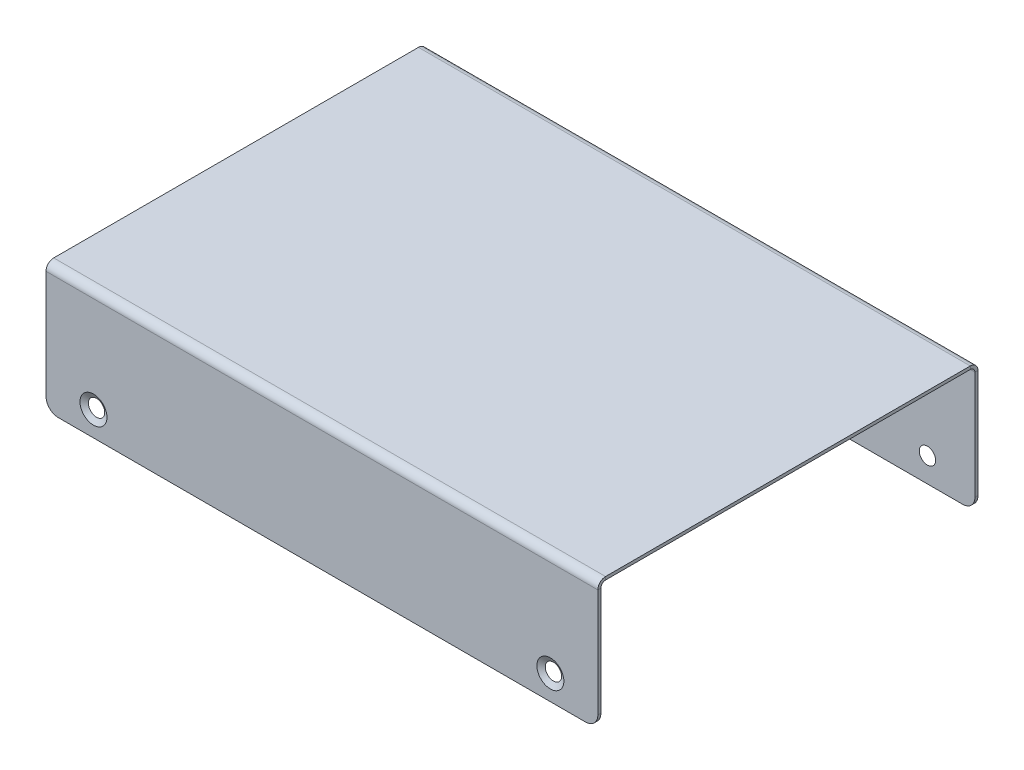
ISO-10303-21;
HEADER;
FILE_DESCRIPTION(('STEP AP214'),'2;1');
FILE_NAME('part.step','',(''),(''),'','','');
FILE_SCHEMA(('AUTOMOTIVE_DESIGN { 1 0 10303 214 1 1 1 1 }'));
ENDSEC;
DATA;
#1=APPLICATION_CONTEXT('core data for automotive mechanical design processes');
#2=APPLICATION_PROTOCOL_DEFINITION('international standard','automotive_design',2000,#1);
#3=PRODUCT_CONTEXT('',#1,'mechanical');
#4=PRODUCT('Part','Part','',(#3));
#5=PRODUCT_RELATED_PRODUCT_CATEGORY('part','',(#4));
#6=PRODUCT_DEFINITION_FORMATION('','',#4);
#7=PRODUCT_DEFINITION_CONTEXT('part definition',#1,'design');
#8=PRODUCT_DEFINITION('design','',#6,#7);
#9=PRODUCT_DEFINITION_SHAPE('','',#8);
#10=(LENGTH_UNIT() NAMED_UNIT(*) SI_UNIT(.MILLI.,.METRE.));
#11=(NAMED_UNIT(*) PLANE_ANGLE_UNIT() SI_UNIT($,.RADIAN.));
#12=(NAMED_UNIT(*) SI_UNIT($,.STERADIAN.) SOLID_ANGLE_UNIT());
#13=UNCERTAINTY_MEASURE_WITH_UNIT(LENGTH_MEASURE(1.E-05),#10,'distance_accuracy_value','');
#14=(GEOMETRIC_REPRESENTATION_CONTEXT(3) GLOBAL_UNCERTAINTY_ASSIGNED_CONTEXT((#13)) GLOBAL_UNIT_ASSIGNED_CONTEXT((#10,
#11,#12)) REPRESENTATION_CONTEXT('',''));
#15=CARTESIAN_POINT('',(0.,0.,0.));
#16=DIRECTION('',(0.,0.,1.));
#17=DIRECTION('',(1.,0.,0.));
#18=AXIS2_PLACEMENT_3D('',#15,#16,#17);
#19=CARTESIAN_POINT('',(0.,-0.5,0.));
#20=DIRECTION('',(0.,1.,0.));
#21=DIRECTION('',(0.,0.,1.));
#22=AXIS2_PLACEMENT_3D('',#19,#20,#21);
#23=PLANE('',#22);
#24=DIRECTION('',(1.,0.,0.));
#25=VECTOR('',#24,1.);
#26=CARTESIAN_POINT('',(44.99,-0.500000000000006,-29.73554));
#27=LINE('',#26,#25);
#28=CARTESIAN_POINT('',(44.99,-0.500000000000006,-29.73554));
#29=VERTEX_POINT('',#28);
#30=CARTESIAN_POINT('',(-44.99,-0.500000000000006,-29.73554));
#31=VERTEX_POINT('',#30);
#32=EDGE_CURVE('E206',#29,#31,#27,.F.);
#33=ORIENTED_EDGE('',*,*,#32,.F.);
#34=DIRECTION('',(0.,0.,-1.));
#35=VECTOR('',#34,1.);
#36=CARTESIAN_POINT('',(44.99,-0.5,-30.495));
#37=LINE('',#36,#35);
#38=CARTESIAN_POINT('',(44.99,-0.5,29.73554));
#39=VERTEX_POINT('',#38);
#40=EDGE_CURVE('E263',#39,#29,#37,.T.);
#41=ORIENTED_EDGE('',*,*,#40,.F.);
#42=DIRECTION('',(-1.,0.,0.));
#43=VECTOR('',#42,1.);
#44=CARTESIAN_POINT('',(-44.99,-0.5,29.73554));
#45=LINE('',#44,#43);
#46=CARTESIAN_POINT('',(-44.99,-0.5,29.73554));
#47=VERTEX_POINT('',#46);
#48=EDGE_CURVE('E250',#47,#39,#45,.F.);
#49=ORIENTED_EDGE('',*,*,#48,.F.);
#50=DIRECTION('',(0.,0.,1.));
#51=VECTOR('',#50,1.);
#52=CARTESIAN_POINT('',(-44.99,-0.5,-30.495));
#53=LINE('',#52,#51);
#54=EDGE_CURVE('E260',#31,#47,#53,.T.);
#55=ORIENTED_EDGE('',*,*,#54,.F.);
#56=EDGE_LOOP('',(#33,#41,#49,#55));
#57=FACE_BOUND('',#56,.T.);
#58=ADVANCED_FACE('F36',(#57),#23,.F.);
#59=CARTESIAN_POINT('',(0.,0.,0.));
#60=DIRECTION('',(0.,1.,0.));
#61=DIRECTION('',(0.,0.,1.));
#62=AXIS2_PLACEMENT_3D('',#59,#60,#61);
#63=PLANE('',#62);
#64=DIRECTION('',(0.,0.,-1.));
#65=VECTOR('',#64,1.);
#66=CARTESIAN_POINT('',(44.99,0.,-30.495));
#67=LINE('',#66,#65);
#68=CARTESIAN_POINT('',(44.99,0.,29.73554));
#69=VERTEX_POINT('',#68);
#70=CARTESIAN_POINT('',(44.99,0.,-29.73554));
#71=VERTEX_POINT('',#70);
#72=EDGE_CURVE('E264',#69,#71,#67,.T.);
#73=ORIENTED_EDGE('',*,*,#72,.T.);
#74=DIRECTION('',(1.,0.,0.));
#75=VECTOR('',#74,1.);
#76=CARTESIAN_POINT('',(44.99,0.,-29.73554));
#77=LINE('',#76,#75);
#78=CARTESIAN_POINT('',(-44.99,0.,-29.73554));
#79=VERTEX_POINT('',#78);
#80=EDGE_CURVE('E158',#71,#79,#77,.F.);
#81=ORIENTED_EDGE('',*,*,#80,.T.);
#82=DIRECTION('',(0.,0.,1.));
#83=VECTOR('',#82,1.);
#84=CARTESIAN_POINT('',(-44.99,0.,-30.495));
#85=LINE('',#84,#83);
#86=CARTESIAN_POINT('',(-44.99,0.,29.73554));
#87=VERTEX_POINT('',#86);
#88=EDGE_CURVE('E257',#79,#87,#85,.T.);
#89=ORIENTED_EDGE('',*,*,#88,.T.);
#90=DIRECTION('',(-1.,0.,0.));
#91=VECTOR('',#90,1.);
#92=CARTESIAN_POINT('',(-44.99,0.,29.73554));
#93=LINE('',#92,#91);
#94=EDGE_CURVE('E237',#87,#69,#93,.F.);
#95=ORIENTED_EDGE('',*,*,#94,.T.);
#96=EDGE_LOOP('',(#73,#81,#89,#95));
#97=FACE_BOUND('',#96,.T.);
#98=ADVANCED_FACE('F369',(#97),#63,.T.);
#99=CARTESIAN_POINT('',(44.99,-0.5,-30.495));
#100=DIRECTION('',(1.,0.,0.));
#101=DIRECTION('',(0.,0.,-1.));
#102=AXIS2_PLACEMENT_3D('',#99,#100,#101);
#103=PLANE('',#102);
#104=ORIENTED_EDGE('',*,*,#40,.T.);
#105=DIRECTION('',(0.,1.,0.));
#106=VECTOR('',#105,1.);
#107=CARTESIAN_POINT('',(44.99,-0.500000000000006,-29.73554));
#108=LINE('',#107,#106);
#109=EDGE_CURVE('E202',#29,#71,#108,.T.);
#110=ORIENTED_EDGE('',*,*,#109,.T.);
#111=ORIENTED_EDGE('',*,*,#72,.F.);
#112=DIRECTION('',(0.,1.,0.));
#113=VECTOR('',#112,1.);
#114=CARTESIAN_POINT('',(44.99,-0.5,29.73554));
#115=LINE('',#114,#113);
#116=EDGE_CURVE('E254',#39,#69,#115,.T.);
#117=ORIENTED_EDGE('',*,*,#116,.F.);
#118=EDGE_LOOP('',(#104,#110,#111,#117));
#119=FACE_BOUND('',#118,.T.);
#120=ADVANCED_FACE('F375',(#119),#103,.T.);
#121=CARTESIAN_POINT('',(-44.99,-0.5,-30.495));
#122=DIRECTION('',(-1.,0.,0.));
#123=DIRECTION('',(0.,0.,1.));
#124=AXIS2_PLACEMENT_3D('',#121,#122,#123);
#125=PLANE('',#124);
#126=DIRECTION('',(0.,1.,0.));
#127=VECTOR('',#126,1.);
#128=CARTESIAN_POINT('',(-44.99,-0.500000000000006,-29.73554));
#129=LINE('',#128,#127);
#130=EDGE_CURVE('E209',#31,#79,#129,.T.);
#131=ORIENTED_EDGE('',*,*,#130,.F.);
#132=ORIENTED_EDGE('',*,*,#54,.T.);
#133=DIRECTION('',(0.,1.,0.));
#134=VECTOR('',#133,1.);
#135=CARTESIAN_POINT('',(-44.99,-0.5,29.73554));
#136=LINE('',#135,#134);
#137=EDGE_CURVE('E244',#47,#87,#136,.T.);
#138=ORIENTED_EDGE('',*,*,#137,.T.);
#139=ORIENTED_EDGE('',*,*,#88,.F.);
#140=EDGE_LOOP('',(#131,#132,#138,#139));
#141=FACE_BOUND('',#140,.T.);
#142=ADVANCED_FACE('F385',(#141),#125,.T.);
#143=CARTESIAN_POINT('',(44.99,-1.25946,29.73554));
#144=DIRECTION('',(1.,0.,0.));
#145=DIRECTION('',(0.,0.,-1.));
#146=AXIS2_PLACEMENT_3D('',#143,#144,#145);
#147=PLANE('',#146);
#148=DIRECTION('',(0.,0.,1.));
#149=VECTOR('',#148,1.);
#150=CARTESIAN_POINT('',(44.99,-1.25946,30.495));
#151=LINE('',#150,#149);
#152=CARTESIAN_POINT('',(44.99,-1.25945999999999,30.495));
#153=VERTEX_POINT('',#152);
#154=CARTESIAN_POINT('',(44.99,-1.25945999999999,30.995));
#155=VERTEX_POINT('',#154);
#156=EDGE_CURVE('E212',#153,#155,#151,.T.);
#157=ORIENTED_EDGE('',*,*,#156,.F.);
#158=CARTESIAN_POINT('',(44.99,-1.25946,29.73554));
#159=DIRECTION('',(-1.,0.,0.));
#160=DIRECTION('',(0.,0.,1.));
#161=AXIS2_PLACEMENT_3D('',#158,#159,#160);
#162=CIRCLE('',#161,0.759459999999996);
#163=EDGE_CURVE('E247',#39,#153,#162,.F.);
#164=ORIENTED_EDGE('',*,*,#163,.F.);
#165=ORIENTED_EDGE('',*,*,#116,.T.);
#166=CARTESIAN_POINT('',(44.99,-1.25946,29.73554));
#167=DIRECTION('',(-1.,0.,0.));
#168=DIRECTION('',(0.,0.,1.));
#169=AXIS2_PLACEMENT_3D('',#166,#167,#168);
#170=CIRCLE('',#169,1.25946);
#171=EDGE_CURVE('E240',#69,#155,#170,.F.);
#172=ORIENTED_EDGE('',*,*,#171,.T.);
#173=EDGE_LOOP('',(#157,#164,#165,#172));
#174=FACE_BOUND('',#173,.T.);
#175=ADVANCED_FACE('F389',(#174),#147,.T.);
#176=CARTESIAN_POINT('',(-44.99,-1.25946,29.73554));
#177=DIRECTION('',(1.,0.,0.));
#178=DIRECTION('',(0.,0.,-1.));
#179=AXIS2_PLACEMENT_3D('',#176,#177,#178);
#180=PLANE('',#179);
#181=CARTESIAN_POINT('',(-44.99,-1.25946,29.73554));
#182=DIRECTION('',(-1.,0.,0.));
#183=DIRECTION('',(0.,0.,1.));
#184=AXIS2_PLACEMENT_3D('',#181,#182,#183);
#185=CIRCLE('',#184,0.759459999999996);
#186=CARTESIAN_POINT('',(-44.99,-1.25945999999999,30.495));
#187=VERTEX_POINT('',#186);
#188=EDGE_CURVE('E232',#187,#47,#185,.T.);
#189=ORIENTED_EDGE('',*,*,#188,.F.);
#190=DIRECTION('',(0.,0.,1.));
#191=VECTOR('',#190,1.);
#192=CARTESIAN_POINT('',(-44.99,-1.25946,30.495));
#193=LINE('',#192,#191);
#194=CARTESIAN_POINT('',(-44.99,-1.25946,30.995));
#195=VERTEX_POINT('',#194);
#196=EDGE_CURVE('E216',#187,#195,#193,.T.);
#197=ORIENTED_EDGE('',*,*,#196,.T.);
#198=CARTESIAN_POINT('',(-44.99,-1.25946,29.73554));
#199=DIRECTION('',(-1.,0.,0.));
#200=DIRECTION('',(0.,0.,1.));
#201=AXIS2_PLACEMENT_3D('',#198,#199,#200);
#202=CIRCLE('',#201,1.25946);
#203=EDGE_CURVE('E241',#195,#87,#202,.T.);
#204=ORIENTED_EDGE('',*,*,#203,.T.);
#205=ORIENTED_EDGE('',*,*,#137,.F.);
#206=EDGE_LOOP('',(#189,#197,#204,#205));
#207=FACE_BOUND('',#206,.T.);
#208=ADVANCED_FACE('F380',(#207),#180,.F.);
#209=CARTESIAN_POINT('',(-44.99,-1.25946,29.73554));
#210=DIRECTION('',(-1.,0.,0.));
#211=DIRECTION('',(0.,0.,1.));
#212=AXIS2_PLACEMENT_3D('',#209,#210,#211);
#213=CYLINDRICAL_SURFACE('',#212,1.25946);
#214=ORIENTED_EDGE('',*,*,#94,.F.);
#215=ORIENTED_EDGE('',*,*,#203,.F.);
#216=DIRECTION('',(1.,0.,0.));
#217=VECTOR('',#216,1.);
#218=CARTESIAN_POINT('',(0.,-1.25946,30.995));
#219=LINE('',#218,#217);
#220=EDGE_CURVE('E219',#195,#155,#219,.T.);
#221=ORIENTED_EDGE('',*,*,#220,.T.);
#222=ORIENTED_EDGE('',*,*,#171,.F.);
#223=EDGE_LOOP('',(#214,#215,#221,#222));
#224=FACE_BOUND('',#223,.T.);
#225=ADVANCED_FACE('F428',(#224),#213,.T.);
#226=CARTESIAN_POINT('',(-44.99,-1.25946,29.73554));
#227=DIRECTION('',(-1.,0.,0.));
#228=DIRECTION('',(0.,0.,1.));
#229=AXIS2_PLACEMENT_3D('',#226,#227,#228);
#230=CYLINDRICAL_SURFACE('',#229,0.759459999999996);
#231=ORIENTED_EDGE('',*,*,#48,.T.);
#232=ORIENTED_EDGE('',*,*,#163,.T.);
#233=DIRECTION('',(-1.,0.,0.));
#234=VECTOR('',#233,1.);
#235=CARTESIAN_POINT('',(44.99,-1.25946,30.495));
#236=LINE('',#235,#234);
#237=EDGE_CURVE('E214',#153,#187,#236,.T.);
#238=ORIENTED_EDGE('',*,*,#237,.T.);
#239=ORIENTED_EDGE('',*,*,#188,.T.);
#240=EDGE_LOOP('',(#231,#232,#238,#239));
#241=FACE_BOUND('',#240,.T.);
#242=ADVANCED_FACE('F464',(#241),#230,.F.);
#243=CARTESIAN_POINT('',(-44.99,-20.92,30.9950000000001));
#244=DIRECTION('',(1.,0.,0.));
#245=DIRECTION('',(0.,0.,-1.));
#246=AXIS2_PLACEMENT_3D('',#243,#244,#245);
#247=PLANE('',#246);
#248=DIRECTION('',(0.,-1.,0.));
#249=VECTOR('',#248,1.);
#250=CARTESIAN_POINT('',(-44.99,-20.92,30.4950000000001));
#251=LINE('',#250,#249);
#252=CARTESIAN_POINT('',(-44.99,-18.92,30.4950000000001));
#253=VERTEX_POINT('',#252);
#254=EDGE_CURVE('E224',#187,#253,#251,.T.);
#255=ORIENTED_EDGE('',*,*,#254,.T.);
#256=DIRECTION('',(0.,0.,-1.));
#257=VECTOR('',#256,1.);
#258=CARTESIAN_POINT('',(-44.99,-18.92,30.9950000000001));
#259=LINE('',#258,#257);
#260=CARTESIAN_POINT('',(-44.99,-18.92,30.9950000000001));
#261=VERTEX_POINT('',#260);
#262=EDGE_CURVE('E11',#253,#261,#259,.F.);
#263=ORIENTED_EDGE('',*,*,#262,.T.);
#264=DIRECTION('',(0.,-1.,0.));
#265=VECTOR('',#264,1.);
#266=CARTESIAN_POINT('',(-44.99,-20.92,30.9950000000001));
#267=LINE('',#266,#265);
#268=EDGE_CURVE('E225',#195,#261,#267,.T.);
#269=ORIENTED_EDGE('',*,*,#268,.F.);
#270=ORIENTED_EDGE('',*,*,#196,.F.);
#271=EDGE_LOOP('',(#255,#263,#269,#270));
#272=FACE_BOUND('',#271,.T.);
#273=ADVANCED_FACE('F460',(#272),#247,.F.);
#274=CARTESIAN_POINT('',(44.99,-0.499999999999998,30.995));
#275=DIRECTION('',(-1.,0.,0.));
#276=DIRECTION('',(0.,0.,1.));
#277=AXIS2_PLACEMENT_3D('',#274,#275,#276);
#278=PLANE('',#277);
#279=DIRECTION('',(0.,1.,0.));
#280=VECTOR('',#279,1.);
#281=CARTESIAN_POINT('',(44.99,-0.499999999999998,30.995));
#282=LINE('',#281,#280);
#283=CARTESIAN_POINT('',(44.99,-18.92,30.9950000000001));
#284=VERTEX_POINT('',#283);
#285=EDGE_CURVE('E230',#284,#155,#282,.T.);
#286=ORIENTED_EDGE('',*,*,#285,.F.);
#287=DIRECTION('',(0.,0.,-1.));
#288=VECTOR('',#287,1.);
#289=CARTESIAN_POINT('',(44.99,-18.92,30.9950000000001));
#290=LINE('',#289,#288);
#291=CARTESIAN_POINT('',(44.99,-18.92,30.4950000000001));
#292=VERTEX_POINT('',#291);
#293=EDGE_CURVE('E285',#284,#292,#290,.T.);
#294=ORIENTED_EDGE('',*,*,#293,.T.);
#295=DIRECTION('',(0.,1.,0.));
#296=VECTOR('',#295,1.);
#297=CARTESIAN_POINT('',(44.99,-0.5,30.495));
#298=LINE('',#297,#296);
#299=EDGE_CURVE('E228',#292,#153,#298,.T.);
#300=ORIENTED_EDGE('',*,*,#299,.T.);
#301=ORIENTED_EDGE('',*,*,#156,.T.);
#302=EDGE_LOOP('',(#286,#294,#300,#301));
#303=FACE_BOUND('',#302,.T.);
#304=ADVANCED_FACE('F425',(#303),#278,.F.);
#305=CARTESIAN_POINT('',(0.,1.05370407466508E-13,30.995));
#306=DIRECTION('',(0.,0.,-1.));
#307=DIRECTION('',(0.,1.,0.));
#308=AXIS2_PLACEMENT_3D('',#305,#306,#307);
#309=PLANE('',#308);
#310=CARTESIAN_POINT('',(-37.25,-16.92,30.995));
#311=DIRECTION('',(0.,0.,1.));
#312=DIRECTION('',(1.,0.,0.));
#313=AXIS2_PLACEMENT_3D('',#310,#311,#312);
#314=CIRCLE('',#313,2.2);
#315=CARTESIAN_POINT('',(-35.05,-16.92,30.995));
#316=VERTEX_POINT('',#315);
#317=EDGE_CURVE('E325',#316,#316,#314,.T.);
#318=ORIENTED_EDGE('',*,*,#317,.F.);
#319=EDGE_LOOP('',(#318));
#320=FACE_BOUND('',#319,.T.);
#321=CARTESIAN_POINT('',(37.25,-16.92,30.995));
#322=DIRECTION('',(0.,0.,1.));
#323=DIRECTION('',(1.,0.,0.));
#324=AXIS2_PLACEMENT_3D('',#321,#322,#323);
#325=CIRCLE('',#324,2.2);
#326=CARTESIAN_POINT('',(39.45,-16.92,30.995));
#327=VERTEX_POINT('',#326);
#328=EDGE_CURVE('E319',#327,#327,#325,.T.);
#329=ORIENTED_EDGE('',*,*,#328,.F.);
#330=EDGE_LOOP('',(#329));
#331=FACE_BOUND('',#330,.T.);
#332=DIRECTION('',(1.,0.,0.));
#333=VECTOR('',#332,1.);
#334=CARTESIAN_POINT('',(44.99,-20.92,30.9950000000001));
#335=LINE('',#334,#333);
#336=CARTESIAN_POINT('',(-42.99,-20.92,30.9950000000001));
#337=VERTEX_POINT('',#336);
#338=CARTESIAN_POINT('',(42.99,-20.92,30.9950000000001));
#339=VERTEX_POINT('',#338);
#340=EDGE_CURVE('E227',#337,#339,#335,.T.);
#341=ORIENTED_EDGE('',*,*,#340,.T.);
#342=CARTESIAN_POINT('',(42.99,-18.92,30.9950000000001));
#343=DIRECTION('',(0.,0.,-1.));
#344=DIRECTION('',(0.,1.,0.));
#345=AXIS2_PLACEMENT_3D('',#342,#343,#344);
#346=CIRCLE('',#345,2.);
#347=EDGE_CURVE('E298',#339,#284,#346,.F.);
#348=ORIENTED_EDGE('',*,*,#347,.T.);
#349=ORIENTED_EDGE('',*,*,#285,.T.);
#350=ORIENTED_EDGE('',*,*,#220,.F.);
#351=ORIENTED_EDGE('',*,*,#268,.T.);
#352=CARTESIAN_POINT('',(-42.99,-18.92,30.9950000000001));
#353=DIRECTION('',(0.,0.,-1.));
#354=DIRECTION('',(0.,1.,0.));
#355=AXIS2_PLACEMENT_3D('',#352,#353,#354);
#356=CIRCLE('',#355,2.);
#357=EDGE_CURVE('E296',#261,#337,#356,.F.);
#358=ORIENTED_EDGE('',*,*,#357,.T.);
#359=EDGE_LOOP('',(#341,#348,#349,#350,#351,#358));
#360=FACE_BOUND('',#359,.T.);
#361=ADVANCED_FACE('F412',(#320,#331,#360),#309,.F.);
#362=CARTESIAN_POINT('',(0.,1.03624666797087E-13,30.495));
#363=DIRECTION('',(0.,0.,-1.));
#364=DIRECTION('',(0.,1.,0.));
#365=AXIS2_PLACEMENT_3D('',#362,#363,#364);
#366=PLANE('',#365);
#367=CARTESIAN_POINT('',(-37.25,-16.92,30.4950000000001));
#368=DIRECTION('',(0.,0.,-1.));
#369=DIRECTION('',(0.,1.,0.));
#370=AXIS2_PLACEMENT_3D('',#367,#368,#369);
#371=CIRCLE('',#370,1.33397459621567);
#372=CARTESIAN_POINT('',(-37.25,-15.5860254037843,30.4950000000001));
#373=VERTEX_POINT('',#372);
#374=EDGE_CURVE('E322',#373,#373,#371,.T.);
#375=ORIENTED_EDGE('',*,*,#374,.F.);
#376=EDGE_LOOP('',(#375));
#377=FACE_BOUND('',#376,.T.);
#378=CARTESIAN_POINT('',(37.25,-16.92,30.495));
#379=DIRECTION('',(0.,0.,-1.));
#380=DIRECTION('',(0.,1.,0.));
#381=AXIS2_PLACEMENT_3D('',#378,#379,#380);
#382=CIRCLE('',#381,1.33397459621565);
#383=CARTESIAN_POINT('',(37.25,-15.5860254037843,30.495));
#384=VERTEX_POINT('',#383);
#385=EDGE_CURVE('E315',#384,#384,#382,.T.);
#386=ORIENTED_EDGE('',*,*,#385,.F.);
#387=EDGE_LOOP('',(#386));
#388=FACE_BOUND('',#387,.T.);
#389=ORIENTED_EDGE('',*,*,#299,.F.);
#390=CARTESIAN_POINT('',(42.99,-18.92,30.4950000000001));
#391=DIRECTION('',(0.,0.,-1.));
#392=DIRECTION('',(0.,1.,0.));
#393=AXIS2_PLACEMENT_3D('',#390,#391,#392);
#394=CIRCLE('',#393,2.);
#395=CARTESIAN_POINT('',(42.99,-20.92,30.4950000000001));
#396=VERTEX_POINT('',#395);
#397=EDGE_CURVE('E290',#292,#396,#394,.T.);
#398=ORIENTED_EDGE('',*,*,#397,.T.);
#399=DIRECTION('',(1.,0.,0.));
#400=VECTOR('',#399,1.);
#401=CARTESIAN_POINT('',(44.99,-20.92,30.4950000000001));
#402=LINE('',#401,#400);
#403=CARTESIAN_POINT('',(-42.99,-20.92,30.4950000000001));
#404=VERTEX_POINT('',#403);
#405=EDGE_CURVE('E234',#404,#396,#402,.T.);
#406=ORIENTED_EDGE('',*,*,#405,.F.);
#407=CARTESIAN_POINT('',(-42.99,-18.92,30.4950000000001));
#408=DIRECTION('',(0.,0.,-1.));
#409=DIRECTION('',(0.,1.,0.));
#410=AXIS2_PLACEMENT_3D('',#407,#408,#409);
#411=CIRCLE('',#410,2.);
#412=EDGE_CURVE('E288',#404,#253,#411,.T.);
#413=ORIENTED_EDGE('',*,*,#412,.T.);
#414=ORIENTED_EDGE('',*,*,#254,.F.);
#415=ORIENTED_EDGE('',*,*,#237,.F.);
#416=EDGE_LOOP('',(#389,#398,#406,#413,#414,#415));
#417=FACE_BOUND('',#416,.T.);
#418=ADVANCED_FACE('F419',(#377,#388,#417),#366,.T.);
#419=CARTESIAN_POINT('',(44.99,-20.92,30.9950000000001));
#420=DIRECTION('',(0.,1.,0.));
#421=DIRECTION('',(0.,0.,1.));
#422=AXIS2_PLACEMENT_3D('',#419,#420,#421);
#423=PLANE('',#422);
#424=ORIENTED_EDGE('',*,*,#405,.T.);
#425=DIRECTION('',(0.,0.,-1.));
#426=VECTOR('',#425,1.);
#427=CARTESIAN_POINT('',(42.99,-20.92,30.9950000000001));
#428=LINE('',#427,#426);
#429=EDGE_CURVE('E57',#396,#339,#428,.F.);
#430=ORIENTED_EDGE('',*,*,#429,.T.);
#431=ORIENTED_EDGE('',*,*,#340,.F.);
#432=DIRECTION('',(0.,0.,-1.));
#433=VECTOR('',#432,1.);
#434=CARTESIAN_POINT('',(-42.99,-20.92,30.9950000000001));
#435=LINE('',#434,#433);
#436=EDGE_CURVE('E292',#337,#404,#435,.T.);
#437=ORIENTED_EDGE('',*,*,#436,.T.);
#438=EDGE_LOOP('',(#424,#430,#431,#437));
#439=FACE_BOUND('',#438,.T.);
#440=ADVANCED_FACE('F415',(#439),#423,.F.);
#441=CARTESIAN_POINT('',(-44.99,-1.25946,-29.73554));
#442=DIRECTION('',(-1.,0.,0.));
#443=DIRECTION('',(0.,0.,1.));
#444=AXIS2_PLACEMENT_3D('',#441,#442,#443);
#445=PLANE('',#444);
#446=DIRECTION('',(0.,0.,-1.));
#447=VECTOR('',#446,1.);
#448=CARTESIAN_POINT('',(-44.99,-1.25946,-30.495));
#449=LINE('',#448,#447);
#450=CARTESIAN_POINT('',(-44.99,-1.25946,-30.495));
#451=VERTEX_POINT('',#450);
#452=CARTESIAN_POINT('',(-44.99,-1.25946,-30.995));
#453=VERTEX_POINT('',#452);
#454=EDGE_CURVE('E313',#451,#453,#449,.T.);
#455=ORIENTED_EDGE('',*,*,#454,.F.);
#456=CARTESIAN_POINT('',(-44.99,-1.25946,-29.73554));
#457=DIRECTION('',(1.,0.,0.));
#458=DIRECTION('',(0.,0.,-1.));
#459=AXIS2_PLACEMENT_3D('',#456,#457,#458);
#460=CIRCLE('',#459,0.759459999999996);
#461=EDGE_CURVE('E161',#31,#451,#460,.F.);
#462=ORIENTED_EDGE('',*,*,#461,.F.);
#463=ORIENTED_EDGE('',*,*,#130,.T.);
#464=CARTESIAN_POINT('',(-44.99,-1.25946,-29.73554));
#465=DIRECTION('',(1.,0.,0.));
#466=DIRECTION('',(0.,0.,-1.));
#467=AXIS2_PLACEMENT_3D('',#464,#465,#466);
#468=CIRCLE('',#467,1.25946);
#469=EDGE_CURVE('E201',#79,#453,#468,.F.);
#470=ORIENTED_EDGE('',*,*,#469,.T.);
#471=EDGE_LOOP('',(#455,#462,#463,#470));
#472=FACE_BOUND('',#471,.T.);
#473=ADVANCED_FACE('F441',(#472),#445,.T.);
#474=CARTESIAN_POINT('',(44.99,-1.25946,-29.73554));
#475=DIRECTION('',(-1.,0.,0.));
#476=DIRECTION('',(0.,0.,1.));
#477=AXIS2_PLACEMENT_3D('',#474,#475,#476);
#478=PLANE('',#477);
#479=CARTESIAN_POINT('',(44.99,-1.25946,-29.73554));
#480=DIRECTION('',(1.,0.,0.));
#481=DIRECTION('',(0.,0.,-1.));
#482=AXIS2_PLACEMENT_3D('',#479,#480,#481);
#483=CIRCLE('',#482,0.759459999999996);
#484=CARTESIAN_POINT('',(44.99,-1.25946,-30.495));
#485=VERTEX_POINT('',#484);
#486=EDGE_CURVE('E168',#485,#29,#483,.T.);
#487=ORIENTED_EDGE('',*,*,#486,.F.);
#488=DIRECTION('',(0.,0.,-1.));
#489=VECTOR('',#488,1.);
#490=CARTESIAN_POINT('',(44.99,-1.25946,-30.495));
#491=LINE('',#490,#489);
#492=CARTESIAN_POINT('',(44.99,-1.25945999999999,-30.995));
#493=VERTEX_POINT('',#492);
#494=EDGE_CURVE('E165',#485,#493,#491,.T.);
#495=ORIENTED_EDGE('',*,*,#494,.T.);
#496=CARTESIAN_POINT('',(44.99,-1.25946,-29.73554));
#497=DIRECTION('',(1.,0.,0.));
#498=DIRECTION('',(0.,0.,-1.));
#499=AXIS2_PLACEMENT_3D('',#496,#497,#498);
#500=CIRCLE('',#499,1.25946);
#501=EDGE_CURVE('E151',#493,#71,#500,.T.);
#502=ORIENTED_EDGE('',*,*,#501,.T.);
#503=ORIENTED_EDGE('',*,*,#109,.F.);
#504=EDGE_LOOP('',(#487,#495,#502,#503));
#505=FACE_BOUND('',#504,.T.);
#506=ADVANCED_FACE('F166',(#505),#478,.F.);
#507=CARTESIAN_POINT('',(44.99,-1.25946,-29.73554));
#508=DIRECTION('',(1.,0.,0.));
#509=DIRECTION('',(0.,0.,-1.));
#510=AXIS2_PLACEMENT_3D('',#507,#508,#509);
#511=CYLINDRICAL_SURFACE('',#510,1.25946);
#512=ORIENTED_EDGE('',*,*,#80,.F.);
#513=ORIENTED_EDGE('',*,*,#501,.F.);
#514=DIRECTION('',(-1.,0.,0.));
#515=VECTOR('',#514,1.);
#516=CARTESIAN_POINT('',(0.,-1.25945999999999,-30.995));
#517=LINE('',#516,#515);
#518=EDGE_CURVE('E155',#493,#453,#517,.T.);
#519=ORIENTED_EDGE('',*,*,#518,.T.);
#520=ORIENTED_EDGE('',*,*,#469,.F.);
#521=EDGE_LOOP('',(#512,#513,#519,#520));
#522=FACE_BOUND('',#521,.T.);
#523=ADVANCED_FACE('F153',(#522),#511,.T.);
#524=CARTESIAN_POINT('',(44.99,-1.25946,-29.73554));
#525=DIRECTION('',(1.,0.,0.));
#526=DIRECTION('',(0.,0.,-1.));
#527=AXIS2_PLACEMENT_3D('',#524,#525,#526);
#528=CYLINDRICAL_SURFACE('',#527,0.759459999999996);
#529=ORIENTED_EDGE('',*,*,#32,.T.);
#530=ORIENTED_EDGE('',*,*,#461,.T.);
#531=DIRECTION('',(1.,0.,0.));
#532=VECTOR('',#531,1.);
#533=CARTESIAN_POINT('',(-44.99,-1.25946,-30.495));
#534=LINE('',#533,#532);
#535=EDGE_CURVE('E173',#451,#485,#534,.T.);
#536=ORIENTED_EDGE('',*,*,#535,.T.);
#537=ORIENTED_EDGE('',*,*,#486,.T.);
#538=EDGE_LOOP('',(#529,#530,#536,#537));
#539=FACE_BOUND('',#538,.T.);
#540=ADVANCED_FACE('F435',(#539),#528,.F.);
#541=CARTESIAN_POINT('',(44.99,-20.92,-30.9950000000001));
#542=DIRECTION('',(-1.,0.,0.));
#543=DIRECTION('',(0.,0.,1.));
#544=AXIS2_PLACEMENT_3D('',#541,#542,#543);
#545=PLANE('',#544);
#546=DIRECTION('',(0.,-1.,0.));
#547=VECTOR('',#546,1.);
#548=CARTESIAN_POINT('',(44.99,-20.92,-30.4950000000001));
#549=LINE('',#548,#547);
#550=CARTESIAN_POINT('',(44.99,-18.92,-30.4950000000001));
#551=VERTEX_POINT('',#550);
#552=EDGE_CURVE('E182',#485,#551,#549,.T.);
#553=ORIENTED_EDGE('',*,*,#552,.T.);
#554=DIRECTION('',(0.,0.,1.));
#555=VECTOR('',#554,1.);
#556=CARTESIAN_POINT('',(44.99,-18.92,-30.9950000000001));
#557=LINE('',#556,#555);
#558=CARTESIAN_POINT('',(44.99,-18.92,-30.9950000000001));
#559=VERTEX_POINT('',#558);
#560=EDGE_CURVE('E186',#551,#559,#557,.F.);
#561=ORIENTED_EDGE('',*,*,#560,.T.);
#562=DIRECTION('',(0.,-1.,0.));
#563=VECTOR('',#562,1.);
#564=CARTESIAN_POINT('',(44.99,-20.92,-30.9950000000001));
#565=LINE('',#564,#563);
#566=EDGE_CURVE('E178',#493,#559,#565,.T.);
#567=ORIENTED_EDGE('',*,*,#566,.F.);
#568=ORIENTED_EDGE('',*,*,#494,.F.);
#569=EDGE_LOOP('',(#553,#561,#567,#568));
#570=FACE_BOUND('',#569,.T.);
#571=ADVANCED_FACE('F184',(#570),#545,.F.);
#572=CARTESIAN_POINT('',(-44.99,-0.499999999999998,-30.995));
#573=DIRECTION('',(1.,0.,0.));
#574=DIRECTION('',(0.,0.,-1.));
#575=AXIS2_PLACEMENT_3D('',#572,#573,#574);
#576=PLANE('',#575);
#577=DIRECTION('',(0.,1.,0.));
#578=VECTOR('',#577,1.);
#579=CARTESIAN_POINT('',(-44.99,-0.499999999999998,-30.995));
#580=LINE('',#579,#578);
#581=CARTESIAN_POINT('',(-44.99,-18.92,-30.995));
#582=VERTEX_POINT('',#581);
#583=EDGE_CURVE('E181',#582,#453,#580,.T.);
#584=ORIENTED_EDGE('',*,*,#583,.F.);
#585=DIRECTION('',(0.,0.,1.));
#586=VECTOR('',#585,1.);
#587=CARTESIAN_POINT('',(-44.99,-18.92,-30.995));
#588=LINE('',#587,#586);
#589=CARTESIAN_POINT('',(-44.99,-18.92,-30.495));
#590=VERTEX_POINT('',#589);
#591=EDGE_CURVE('E44',#582,#590,#588,.T.);
#592=ORIENTED_EDGE('',*,*,#591,.T.);
#593=DIRECTION('',(0.,1.,0.));
#594=VECTOR('',#593,1.);
#595=CARTESIAN_POINT('',(-44.99,-0.5,-30.495));
#596=LINE('',#595,#594);
#597=EDGE_CURVE('E188',#590,#451,#596,.T.);
#598=ORIENTED_EDGE('',*,*,#597,.T.);
#599=ORIENTED_EDGE('',*,*,#454,.T.);
#600=EDGE_LOOP('',(#584,#592,#598,#599));
#601=FACE_BOUND('',#600,.T.);
#602=ADVANCED_FACE('F303',(#601),#576,.F.);
#603=CARTESIAN_POINT('',(0.,1.05370407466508E-13,-30.995));
#604=DIRECTION('',(0.,0.,1.));
#605=DIRECTION('',(0.,-1.,0.));
#606=AXIS2_PLACEMENT_3D('',#603,#604,#605);
#607=PLANE('',#606);
#608=CARTESIAN_POINT('',(37.25,-16.9199999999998,-30.9950000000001));
#609=DIRECTION('',(0.,0.,-1.));
#610=DIRECTION('',(0.,1.,0.));
#611=AXIS2_PLACEMENT_3D('',#608,#609,#610);
#612=CIRCLE('',#611,2.2);
#613=CARTESIAN_POINT('',(37.25,-14.7199999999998,-30.995));
#614=VERTEX_POINT('',#613);
#615=EDGE_CURVE('E337',#614,#614,#612,.T.);
#616=ORIENTED_EDGE('',*,*,#615,.F.);
#617=EDGE_LOOP('',(#616));
#618=FACE_BOUND('',#617,.T.);
#619=CARTESIAN_POINT('',(-37.25,-16.9199999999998,-30.995));
#620=DIRECTION('',(0.,0.,-1.));
#621=DIRECTION('',(0.,1.,0.));
#622=AXIS2_PLACEMENT_3D('',#619,#620,#621);
#623=CIRCLE('',#622,2.2);
#624=CARTESIAN_POINT('',(-37.25,-14.7199999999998,-30.995));
#625=VERTEX_POINT('',#624);
#626=EDGE_CURVE('E331',#625,#625,#623,.T.);
#627=ORIENTED_EDGE('',*,*,#626,.F.);
#628=EDGE_LOOP('',(#627));
#629=FACE_BOUND('',#628,.T.);
#630=ORIENTED_EDGE('',*,*,#566,.T.);
#631=CARTESIAN_POINT('',(42.99,-18.92,-30.9950000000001));
#632=DIRECTION('',(0.,0.,1.));
#633=DIRECTION('',(0.,-1.,0.));
#634=AXIS2_PLACEMENT_3D('',#631,#632,#633);
#635=CIRCLE('',#634,2.);
#636=CARTESIAN_POINT('',(42.99,-20.92,-30.9950000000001));
#637=VERTEX_POINT('',#636);
#638=EDGE_CURVE('E283',#559,#637,#635,.F.);
#639=ORIENTED_EDGE('',*,*,#638,.T.);
#640=DIRECTION('',(-1.,0.,0.));
#641=VECTOR('',#640,1.);
#642=CARTESIAN_POINT('',(-44.99,-20.92,-30.9950000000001));
#643=LINE('',#642,#641);
#644=CARTESIAN_POINT('',(-42.99,-20.92,-30.9950000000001));
#645=VERTEX_POINT('',#644);
#646=EDGE_CURVE('E187',#637,#645,#643,.T.);
#647=ORIENTED_EDGE('',*,*,#646,.T.);
#648=CARTESIAN_POINT('',(-42.99,-18.92,-30.995));
#649=DIRECTION('',(0.,0.,1.));
#650=DIRECTION('',(0.,-1.,0.));
#651=AXIS2_PLACEMENT_3D('',#648,#649,#650);
#652=CIRCLE('',#651,2.);
#653=EDGE_CURVE('E281',#645,#582,#652,.F.);
#654=ORIENTED_EDGE('',*,*,#653,.T.);
#655=ORIENTED_EDGE('',*,*,#583,.T.);
#656=ORIENTED_EDGE('',*,*,#518,.F.);
#657=EDGE_LOOP('',(#630,#639,#647,#654,#655,#656));
#658=FACE_BOUND('',#657,.T.);
#659=ADVANCED_FACE('F177',(#618,#629,#658),#607,.F.);
#660=CARTESIAN_POINT('',(0.,1.03624666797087E-13,-30.495));
#661=DIRECTION('',(0.,0.,1.));
#662=DIRECTION('',(0.,-1.,0.));
#663=AXIS2_PLACEMENT_3D('',#660,#661,#662);
#664=PLANE('',#663);
#665=CARTESIAN_POINT('',(37.25,-16.9199999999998,-30.495));
#666=DIRECTION('',(0.,0.,1.));
#667=DIRECTION('',(0.,-1.,0.));
#668=AXIS2_PLACEMENT_3D('',#665,#666,#667);
#669=CIRCLE('',#668,1.33397459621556);
#670=CARTESIAN_POINT('',(37.25,-18.2539745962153,-30.4950000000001));
#671=VERTEX_POINT('',#670);
#672=EDGE_CURVE('E334',#671,#671,#669,.T.);
#673=ORIENTED_EDGE('',*,*,#672,.F.);
#674=EDGE_LOOP('',(#673));
#675=FACE_BOUND('',#674,.T.);
#676=CARTESIAN_POINT('',(-37.25,-16.9199999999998,-30.495));
#677=DIRECTION('',(0.,0.,1.));
#678=DIRECTION('',(0.,-1.,0.));
#679=AXIS2_PLACEMENT_3D('',#676,#677,#678);
#680=CIRCLE('',#679,1.33397459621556);
#681=CARTESIAN_POINT('',(-37.25,-18.2539745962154,-30.495));
#682=VERTEX_POINT('',#681);
#683=EDGE_CURVE('E328',#682,#682,#680,.T.);
#684=ORIENTED_EDGE('',*,*,#683,.F.);
#685=EDGE_LOOP('',(#684));
#686=FACE_BOUND('',#685,.T.);
#687=DIRECTION('',(-1.,0.,0.));
#688=VECTOR('',#687,1.);
#689=CARTESIAN_POINT('',(-44.99,-20.92,-30.4950000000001));
#690=LINE('',#689,#688);
#691=CARTESIAN_POINT('',(42.99,-20.92,-30.4950000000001));
#692=VERTEX_POINT('',#691);
#693=CARTESIAN_POINT('',(-42.99,-20.92,-30.4950000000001));
#694=VERTEX_POINT('',#693);
#695=EDGE_CURVE('E192',#692,#694,#690,.T.);
#696=ORIENTED_EDGE('',*,*,#695,.F.);
#697=CARTESIAN_POINT('',(42.99,-18.92,-30.4950000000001));
#698=DIRECTION('',(0.,0.,1.));
#699=DIRECTION('',(0.,-1.,0.));
#700=AXIS2_PLACEMENT_3D('',#697,#698,#699);
#701=CIRCLE('',#700,2.);
#702=EDGE_CURVE('E278',#692,#551,#701,.T.);
#703=ORIENTED_EDGE('',*,*,#702,.T.);
#704=ORIENTED_EDGE('',*,*,#552,.F.);
#705=ORIENTED_EDGE('',*,*,#535,.F.);
#706=ORIENTED_EDGE('',*,*,#597,.F.);
#707=CARTESIAN_POINT('',(-42.99,-18.92,-30.495));
#708=DIRECTION('',(0.,0.,1.));
#709=DIRECTION('',(0.,-1.,0.));
#710=AXIS2_PLACEMENT_3D('',#707,#708,#709);
#711=CIRCLE('',#710,2.);
#712=EDGE_CURVE('E276',#590,#694,#711,.T.);
#713=ORIENTED_EDGE('',*,*,#712,.T.);
#714=EDGE_LOOP('',(#696,#703,#704,#705,#706,#713));
#715=FACE_BOUND('',#714,.T.);
#716=ADVANCED_FACE('F311',(#675,#686,#715),#664,.T.);
#717=CARTESIAN_POINT('',(-44.99,-20.92,-30.9950000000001));
#718=DIRECTION('',(0.,1.,0.));
#719=DIRECTION('',(0.,0.,1.));
#720=AXIS2_PLACEMENT_3D('',#717,#718,#719);
#721=PLANE('',#720);
#722=ORIENTED_EDGE('',*,*,#646,.F.);
#723=DIRECTION('',(0.,0.,1.));
#724=VECTOR('',#723,1.);
#725=CARTESIAN_POINT('',(42.99,-20.92,-30.9950000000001));
#726=LINE('',#725,#724);
#727=EDGE_CURVE('E273',#637,#692,#726,.T.);
#728=ORIENTED_EDGE('',*,*,#727,.T.);
#729=ORIENTED_EDGE('',*,*,#695,.T.);
#730=DIRECTION('',(0.,0.,1.));
#731=VECTOR('',#730,1.);
#732=CARTESIAN_POINT('',(-42.99,-20.92,-30.9950000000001));
#733=LINE('',#732,#731);
#734=EDGE_CURVE('E267',#694,#645,#733,.F.);
#735=ORIENTED_EDGE('',*,*,#734,.T.);
#736=EDGE_LOOP('',(#722,#728,#729,#735));
#737=FACE_BOUND('',#736,.T.);
#738=ADVANCED_FACE('F357',(#737),#721,.F.);
#739=CARTESIAN_POINT('',(37.25,-16.92,30.995));
#740=DIRECTION('',(0.,0.,1.));
#741=DIRECTION('',(1.,0.,0.));
#742=AXIS2_PLACEMENT_3D('',#739,#740,#741);
#743=CONICAL_SURFACE('',#742,2.2,1.0471975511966);
#744=ORIENTED_EDGE('',*,*,#328,.T.);
#745=EDGE_LOOP('',(#744));
#746=FACE_BOUND('',#745,.T.);
#747=ORIENTED_EDGE('',*,*,#385,.T.);
#748=EDGE_LOOP('',(#747));
#749=FACE_BOUND('',#748,.T.);
#750=ADVANCED_FACE('F363',(#746,#749),#743,.F.);
#751=CARTESIAN_POINT('',(-37.25,-16.92,30.995));
#752=DIRECTION('',(0.,0.,1.));
#753=DIRECTION('',(1.,0.,0.));
#754=AXIS2_PLACEMENT_3D('',#751,#752,#753);
#755=CONICAL_SURFACE('',#754,2.2,1.0471975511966);
#756=ORIENTED_EDGE('',*,*,#317,.T.);
#757=EDGE_LOOP('',(#756));
#758=FACE_BOUND('',#757,.T.);
#759=ORIENTED_EDGE('',*,*,#374,.T.);
#760=EDGE_LOOP('',(#759));
#761=FACE_BOUND('',#760,.T.);
#762=ADVANCED_FACE('F352',(#758,#761),#755,.F.);
#763=CARTESIAN_POINT('',(-37.25,-16.9199999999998,-30.995));
#764=DIRECTION('',(0.,0.,-1.));
#765=DIRECTION('',(0.,1.,0.));
#766=AXIS2_PLACEMENT_3D('',#763,#764,#765);
#767=CONICAL_SURFACE('',#766,2.2,1.0471975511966);
#768=ORIENTED_EDGE('',*,*,#626,.T.);
#769=EDGE_LOOP('',(#768));
#770=FACE_BOUND('',#769,.T.);
#771=ORIENTED_EDGE('',*,*,#683,.T.);
#772=EDGE_LOOP('',(#771));
#773=FACE_BOUND('',#772,.T.);
#774=ADVANCED_FACE('F349',(#770,#773),#767,.F.);
#775=CARTESIAN_POINT('',(37.25,-16.9199999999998,-30.9950000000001));
#776=DIRECTION('',(0.,0.,-1.));
#777=DIRECTION('',(0.,1.,0.));
#778=AXIS2_PLACEMENT_3D('',#775,#776,#777);
#779=CONICAL_SURFACE('',#778,2.2,1.0471975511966);
#780=ORIENTED_EDGE('',*,*,#615,.T.);
#781=EDGE_LOOP('',(#780));
#782=FACE_BOUND('',#781,.T.);
#783=ORIENTED_EDGE('',*,*,#672,.T.);
#784=EDGE_LOOP('',(#783));
#785=FACE_BOUND('',#784,.T.);
#786=ADVANCED_FACE('F341',(#782,#785),#779,.F.);
#787=CARTESIAN_POINT('',(42.99,-18.92,-30.9950000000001));
#788=DIRECTION('',(0.,0.,1.));
#789=DIRECTION('',(0.,-1.,0.));
#790=AXIS2_PLACEMENT_3D('',#787,#788,#789);
#791=CYLINDRICAL_SURFACE('',#790,2.);
#792=ORIENTED_EDGE('',*,*,#638,.F.);
#793=ORIENTED_EDGE('',*,*,#560,.F.);
#794=ORIENTED_EDGE('',*,*,#702,.F.);
#795=ORIENTED_EDGE('',*,*,#727,.F.);
#796=EDGE_LOOP('',(#792,#793,#794,#795));
#797=FACE_BOUND('',#796,.T.);
#798=ADVANCED_FACE('F391',(#797),#791,.T.);
#799=CARTESIAN_POINT('',(42.99,-18.92,30.9950000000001));
#800=DIRECTION('',(0.,0.,-1.));
#801=DIRECTION('',(0.,1.,0.));
#802=AXIS2_PLACEMENT_3D('',#799,#800,#801);
#803=CYLINDRICAL_SURFACE('',#802,2.);
#804=ORIENTED_EDGE('',*,*,#347,.F.);
#805=ORIENTED_EDGE('',*,*,#429,.F.);
#806=ORIENTED_EDGE('',*,*,#397,.F.);
#807=ORIENTED_EDGE('',*,*,#293,.F.);
#808=EDGE_LOOP('',(#804,#805,#806,#807));
#809=FACE_BOUND('',#808,.T.);
#810=ADVANCED_FACE('F394',(#809),#803,.T.);
#811=CARTESIAN_POINT('',(-42.99,-18.92,-30.995));
#812=DIRECTION('',(0.,0.,1.));
#813=DIRECTION('',(0.,-1.,0.));
#814=AXIS2_PLACEMENT_3D('',#811,#812,#813);
#815=CYLINDRICAL_SURFACE('',#814,2.);
#816=ORIENTED_EDGE('',*,*,#653,.F.);
#817=ORIENTED_EDGE('',*,*,#734,.F.);
#818=ORIENTED_EDGE('',*,*,#712,.F.);
#819=ORIENTED_EDGE('',*,*,#591,.F.);
#820=EDGE_LOOP('',(#816,#817,#818,#819));
#821=FACE_BOUND('',#820,.T.);
#822=ADVANCED_FACE('F397',(#821),#815,.T.);
#823=CARTESIAN_POINT('',(-42.99,-18.92,30.9950000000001));
#824=DIRECTION('',(0.,0.,-1.));
#825=DIRECTION('',(0.,1.,0.));
#826=AXIS2_PLACEMENT_3D('',#823,#824,#825);
#827=CYLINDRICAL_SURFACE('',#826,2.);
#828=ORIENTED_EDGE('',*,*,#357,.F.);
#829=ORIENTED_EDGE('',*,*,#262,.F.);
#830=ORIENTED_EDGE('',*,*,#412,.F.);
#831=ORIENTED_EDGE('',*,*,#436,.F.);
#832=EDGE_LOOP('',(#828,#829,#830,#831));
#833=FACE_BOUND('',#832,.T.);
#834=ADVANCED_FACE('F38',(#833),#827,.T.);
#835=CLOSED_SHELL('',(#58,#98,#120,#142,#175,#208,#225,#242,#273,#304,#361,#418,#440,#473,#506,
#523,#540,#571,#602,#659,#716,#738,#750,#762,#774,#786,#798,#810,#822,#834));
#836=MANIFOLD_SOLID_BREP('B2',#835);
#837=ADVANCED_BREP_SHAPE_REPRESENTATION('',(#18,#836),#14);
#838=SHAPE_DEFINITION_REPRESENTATION(#9,#837);
ENDSEC;
END-ISO-10303-21;
